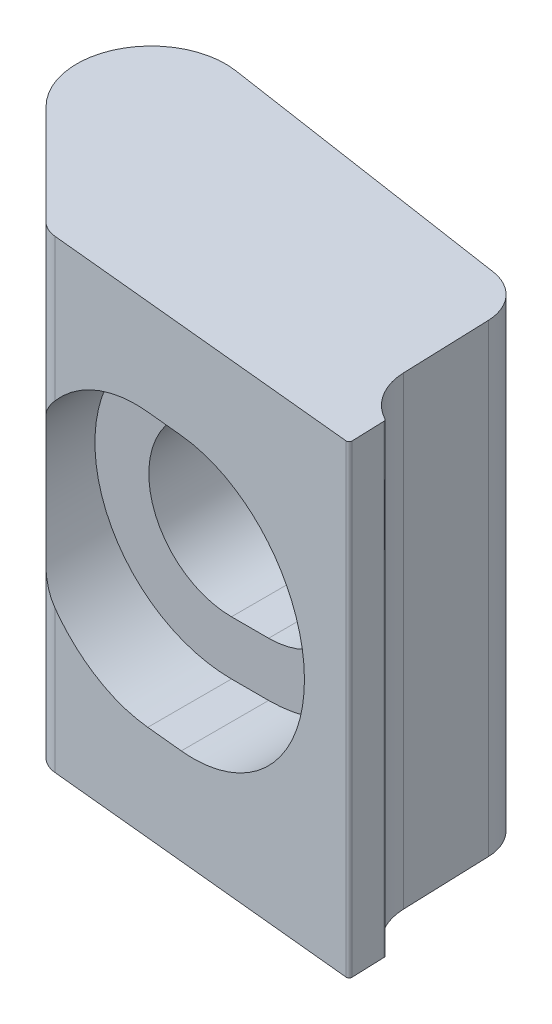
ISO-10303-21;
HEADER;
FILE_DESCRIPTION(('STEP AP214'),'2;1');
FILE_NAME('part.step','',(''),(''),'','','');
FILE_SCHEMA(('AUTOMOTIVE_DESIGN { 1 0 10303 214 1 1 1 1 }'));
ENDSEC;
DATA;
#1=APPLICATION_CONTEXT('core data for automotive mechanical design processes');
#2=APPLICATION_PROTOCOL_DEFINITION('international standard','automotive_design',2000,#1);
#3=PRODUCT_CONTEXT('',#1,'mechanical');
#4=PRODUCT('Part','Part','',(#3));
#5=PRODUCT_RELATED_PRODUCT_CATEGORY('part','',(#4));
#6=PRODUCT_DEFINITION_FORMATION('','',#4);
#7=PRODUCT_DEFINITION_CONTEXT('part definition',#1,'design');
#8=PRODUCT_DEFINITION('design','',#6,#7);
#9=PRODUCT_DEFINITION_SHAPE('','',#8);
#10=(LENGTH_UNIT() NAMED_UNIT(*) SI_UNIT(.MILLI.,.METRE.));
#11=(NAMED_UNIT(*) PLANE_ANGLE_UNIT() SI_UNIT($,.RADIAN.));
#12=(NAMED_UNIT(*) SI_UNIT($,.STERADIAN.) SOLID_ANGLE_UNIT());
#13=UNCERTAINTY_MEASURE_WITH_UNIT(LENGTH_MEASURE(1.E-05),#10,'distance_accuracy_value','');
#14=(GEOMETRIC_REPRESENTATION_CONTEXT(3) GLOBAL_UNCERTAINTY_ASSIGNED_CONTEXT((#13)) GLOBAL_UNIT_ASSIGNED_CONTEXT((#10,
#11,#12)) REPRESENTATION_CONTEXT('',''));
#15=CARTESIAN_POINT('',(0.,0.,0.));
#16=DIRECTION('',(0.,0.,1.));
#17=DIRECTION('',(1.,0.,0.));
#18=AXIS2_PLACEMENT_3D('',#15,#16,#17);
#19=CARTESIAN_POINT('',(-5.6332114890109,9.525,8.48578534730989));
#20=DIRECTION('',(0.,-1.,0.));
#21=DIRECTION('',(1.,0.,0.));
#22=AXIS2_PLACEMENT_3D('',#19,#20,#21);
#23=CYLINDRICAL_SURFACE('',#22,1.143);
#24=DIRECTION('',(0.,-1.,0.));
#25=VECTOR('',#24,1.);
#26=CARTESIAN_POINT('',(-6.44143453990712,9.525,9.29400839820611));
#27=LINE('',#26,#25);
#28=CARTESIAN_POINT('',(-6.44143453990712,9.525,9.29400839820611));
#29=VERTEX_POINT('',#28);
#30=CARTESIAN_POINT('',(-6.44143453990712,2.68079802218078,9.29400839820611));
#31=VERTEX_POINT('',#30);
#32=EDGE_CURVE('E192',#29,#31,#27,.T.);
#33=ORIENTED_EDGE('',*,*,#32,.T.);
#34=CARTESIAN_POINT('',(-4.4902114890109,4.75072940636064,8.48578534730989));
#35=CARTESIAN_POINT('',(-4.49021469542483,4.75072833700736,8.42949001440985));
#36=CARTESIAN_POINT('',(-4.49439454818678,4.74812553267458,8.3731533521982));
#37=CARTESIAN_POINT('',(-4.51089792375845,4.73776021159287,8.26213643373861));
#38=CARTESIAN_POINT('',(-4.52323094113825,4.72999167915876,8.2074581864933));
#39=CARTESIAN_POINT('',(-4.5553350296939,4.70948055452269,8.10148309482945));
#40=CARTESIAN_POINT('',(-4.57508705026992,4.69675069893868,8.05017798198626));
#41=CARTESIAN_POINT('',(-4.62102342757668,4.66658735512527,7.95206193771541));
#42=CARTESIAN_POINT('',(-4.64720715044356,4.64915433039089,7.90525056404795));
#43=CARTESIAN_POINT('',(-4.70591191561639,4.60918444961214,7.81529323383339));
#44=CARTESIAN_POINT('',(-4.73863845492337,4.58647665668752,7.77235832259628));
#45=CARTESIAN_POINT('',(-4.8083018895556,4.53685258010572,7.69283410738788));
#46=CARTESIAN_POINT('',(-4.84524018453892,4.50993489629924,7.65624692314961));
#47=CARTESIAN_POINT('',(-4.92692834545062,4.4486897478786,7.5852825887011));
#48=CARTESIAN_POINT('',(-4.9720712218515,4.41385436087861,7.55179932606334));
#49=CARTESIAN_POINT('',(-5.06431471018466,4.34022035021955,7.49290736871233));
#50=CARTESIAN_POINT('',(-5.11141662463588,4.30141906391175,7.46750414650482));
#51=CARTESIAN_POINT('',(-5.23147826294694,4.19898852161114,7.41273697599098));
#52=CARTESIAN_POINT('',(-5.30486740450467,4.13312974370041,7.38845180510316));
#53=CARTESIAN_POINT('',(-5.44979945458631,3.99574768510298,7.3551373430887));
#54=CARTESIAN_POINT('',(-5.52133763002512,3.92421148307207,7.34614396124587));
#55=CARTESIAN_POINT('',(-5.68811006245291,3.74805667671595,7.3399700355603));
#56=CARTESIAN_POINT('',(-5.78153990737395,3.64153383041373,7.34886026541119));
#57=CARTESIAN_POINT('',(-5.95848782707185,3.42387599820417,7.38630827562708));
#58=CARTESIAN_POINT('',(-6.04199262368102,3.31273509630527,7.41489206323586));
#59=CARTESIAN_POINT('',(-6.16039883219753,3.14271287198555,7.47064964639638));
#60=CARTESIAN_POINT('',(-6.19928710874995,3.08453155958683,7.49182979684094));
#61=CARTESIAN_POINT('',(-6.27413970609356,2.96796307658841,7.5383656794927));
#62=CARTESIAN_POINT('',(-6.31010466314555,2.90957595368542,7.56372049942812));
#63=CARTESIAN_POINT('',(-6.37910161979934,2.79292379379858,7.61858116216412));
#64=CARTESIAN_POINT('',(-6.41213062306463,2.73465893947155,7.64809116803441));
#65=CARTESIAN_POINT('',(-6.47512508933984,2.6188827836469,7.71143199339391));
#66=CARTESIAN_POINT('',(-6.50509223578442,2.56137108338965,7.74526041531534));
#67=CARTESIAN_POINT('',(-6.5663891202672,2.43875650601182,7.82359159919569));
#68=CARTESIAN_POINT('',(-6.59717682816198,2.3739020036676,7.86893635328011));
#69=CARTESIAN_POINT('',(-6.63964580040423,2.28017353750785,7.94325437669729));
#70=CARTESIAN_POINT('',(-6.65315959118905,2.24958163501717,7.96901837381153));
#71=CARTESIAN_POINT('',(-6.67881238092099,2.19015737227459,8.02311199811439));
#72=CARTESIAN_POINT('',(-6.6909528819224,2.16132310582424,8.05143875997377));
#73=CARTESIAN_POINT('',(-6.71077901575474,2.11321201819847,8.10385033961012));
#74=CARTESIAN_POINT('',(-6.71882286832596,2.09333806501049,8.12724558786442));
#75=CARTESIAN_POINT('',(-6.73378340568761,2.05582212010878,8.17619443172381));
#76=CARTESIAN_POINT('',(-6.74069839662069,2.03818349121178,8.20175118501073));
#77=CARTESIAN_POINT('',(-6.75314803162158,2.00602896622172,8.25563964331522));
#78=CARTESIAN_POINT('',(-6.75866201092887,1.99156021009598,8.28400516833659));
#79=CARTESIAN_POINT('',(-6.76765888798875,1.96775198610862,8.34309859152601));
#80=CARTESIAN_POINT('',(-6.7711499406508,1.9583919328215,8.37381643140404));
#81=CARTESIAN_POINT('',(-6.77495968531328,1.94814870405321,8.42774084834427));
#82=CARTESIAN_POINT('',(-6.7758996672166,1.94560795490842,8.45058690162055));
#83=CARTESIAN_POINT('',(-6.77639118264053,1.94428095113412,8.49640589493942));
#84=CARTESIAN_POINT('',(-6.77594303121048,1.94549384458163,8.51937880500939));
#85=CARTESIAN_POINT('',(-6.77371059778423,1.95150923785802,8.56468096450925));
#86=CARTESIAN_POINT('',(-6.77193112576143,1.95629881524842,8.58701223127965));
#87=CARTESIAN_POINT('',(-6.76720615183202,1.96892736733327,8.63065948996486));
#88=CARTESIAN_POINT('',(-6.76425949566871,1.97676936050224,8.651974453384));
#89=CARTESIAN_POINT('',(-6.75514560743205,2.00080201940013,8.70697018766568));
#90=CARTESIAN_POINT('',(-6.74813407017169,2.01909369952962,8.73958211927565));
#91=CARTESIAN_POINT('',(-6.73219451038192,2.05986233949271,8.80156563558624));
#92=CARTESIAN_POINT('',(-6.72325966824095,2.08235415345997,8.8309251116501));
#93=CARTESIAN_POINT('',(-6.70376213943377,2.13039655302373,8.88737774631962));
#94=CARTESIAN_POINT('',(-6.69317265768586,2.15599557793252,8.91441960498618));
#95=CARTESIAN_POINT('',(-6.67075263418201,2.20898407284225,8.96615056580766));
#96=CARTESIAN_POINT('',(-6.65892079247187,2.23637540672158,8.99083715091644));
#97=CARTESIAN_POINT('',(-6.62176738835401,2.32041919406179,9.06206003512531));
#98=CARTESIAN_POINT('',(-6.59482686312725,2.37884384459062,9.10565429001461));
#99=CARTESIAN_POINT('',(-6.5360415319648,2.50041196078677,9.18865699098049));
#100=CARTESIAN_POINT('',(-6.5040355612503,2.56365029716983,9.22780455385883));
#101=CARTESIAN_POINT('',(-6.4362361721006,2.69128280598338,9.30069463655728));
#102=CARTESIAN_POINT('',(-6.40043930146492,2.75567798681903,9.33443215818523));
#103=CARTESIAN_POINT('',(-6.32518499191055,2.88479628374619,9.39683382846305));
#104=CARTESIAN_POINT('',(-6.28572706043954,2.94951944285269,9.42549729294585));
#105=CARTESIAN_POINT('',(-6.20321759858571,3.07874116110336,9.47771434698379));
#106=CARTESIAN_POINT('',(-6.16016532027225,3.14323967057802,9.50126686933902));
#107=CARTESIAN_POINT('',(-6.03710812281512,3.31938624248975,9.55852949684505));
#108=CARTESIAN_POINT('',(-5.95346329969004,3.43037193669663,9.58673960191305));
#109=CARTESIAN_POINT('',(-5.77637875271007,3.64755014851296,9.62336608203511));
#110=CARTESIAN_POINT('',(-5.68296439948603,3.75375410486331,9.63183245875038));
#111=CARTESIAN_POINT('',(-5.5191909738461,3.92628603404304,9.62503834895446));
#112=CARTESIAN_POINT('',(-5.45076212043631,3.9946943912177,9.61637222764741));
#113=CARTESIAN_POINT('',(-5.31211391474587,4.12639234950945,9.585049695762));
#114=CARTESIAN_POINT('',(-5.2418966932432,4.1896876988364,9.56240925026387));
#115=CARTESIAN_POINT('',(-5.11714942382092,4.29679110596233,9.50742685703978));
#116=CARTESIAN_POINT('',(-5.06241466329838,4.34190375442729,9.47811092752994));
#117=CARTESIAN_POINT('',(-4.95572646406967,4.42670472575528,9.40855466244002));
#118=CARTESIAN_POINT('',(-4.90376966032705,4.46639970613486,9.36832791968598));
#119=CARTESIAN_POINT('',(-4.81354641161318,4.53313823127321,9.28437004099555));
#120=CARTESIAN_POINT('',(-4.77444211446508,4.56118760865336,9.2423433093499));
#121=CARTESIAN_POINT('',(-4.70181412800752,4.61208245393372,9.15088102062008));
#122=CARTESIAN_POINT('',(-4.66829051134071,4.63492785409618,9.10144536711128));
#123=CARTESIAN_POINT('',(-4.60849504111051,4.67493748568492,8.99579804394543));
#124=CARTESIAN_POINT('',(-4.58226962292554,4.69206547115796,8.9395461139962));
#125=CARTESIAN_POINT('',(-4.53905343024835,4.71995391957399,8.82217796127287));
#126=CARTESIAN_POINT('',(-4.52204580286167,4.73072600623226,8.76107085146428));
#127=CARTESIAN_POINT('',(-4.50358675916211,4.74235789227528,8.66373907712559));
#128=CARTESIAN_POINT('',(-4.49858295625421,4.74549386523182,8.62841295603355));
#129=CARTESIAN_POINT('',(-4.49189443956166,4.74967987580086,8.55732521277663));
#130=CARTESIAN_POINT('',(-4.49020945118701,4.75073008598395,8.52156362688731));
#131=CARTESIAN_POINT('',(-4.4902114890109,4.75072940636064,8.48578534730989));
#132=B_SPLINE_CURVE_WITH_KNOTS('',3,(#34,#35,#36,#37,#38,#39,#40,#41,#42,#43,#44,#45,#46,#47,
#48,#49,#50,#51,#52,#53,#54,#55,#56,#57,#58,#59,#60,#61,#62,#63,#64,#65,#66,#67,#68,#69,#70,#71,
#72,#73,#74,#75,#76,#77,#78,#79,#80,#81,#82,#83,#84,#85,#86,#87,#88,#89,#90,#91,#92,#93,#94,#95,
#96,#97,#98,#99,#100,#101,#102,#103,#104,#105,#106,#107,#108,#109,#110,#111,#112,#113,#114,#115,
#116,#117,#118,#119,#120,#121,#122,#123,#124,#125,#126,#127,#128,#129,#130,#131),.UNSPECIFIED.,
.T.,.F.,(4,2,2,2,2,2,2,2,2,2,2,2,2,2,2,2,2,2,2,2,2,2,2,2,2,2,2,2,2,2,2,2,2,2,2,2,2,2,2,2,2,2,2,
2,2,2,2,2,4),(0.,0.168746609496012,0.33769007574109,0.506202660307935,0.6746986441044,
0.849694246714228,1.02474817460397,1.22238324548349,1.42015188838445,1.72310054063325,
2.02675962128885,2.45038828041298,2.8745774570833,3.09377987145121,3.31293444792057,
3.53231017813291,3.75156463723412,4.00570961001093,4.13226772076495,4.25868604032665,
4.35376083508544,4.44897700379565,4.54552526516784,4.64168155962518,4.71037401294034,
4.77905087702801,4.84748080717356,4.9159785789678,5.0294469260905,5.14332443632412,
5.25928570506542,5.37536954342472,5.60797929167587,5.85059968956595,6.09344296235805,
6.33631895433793,6.57924561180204,7.00310547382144,7.42589072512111,7.71640614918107,
8.00659028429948,8.2359829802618,8.46509119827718,8.65597505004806,8.84686138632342,
9.03893584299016,9.23065793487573,9.33791305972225,9.44515931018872),.UNSPECIFIED.);
#133=CARTESIAN_POINT('',(-5.7447487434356,3.68145630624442,9.62333026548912));
#134=VERTEX_POINT('',#133);
#135=EDGE_CURVE('E211',#31,#134,#132,.T.);
#136=ORIENTED_EDGE('',*,*,#135,.T.);
#137=DIRECTION('',(0.,-1.,0.));
#138=VECTOR('',#137,1.);
#139=CARTESIAN_POINT('',(-5.7447487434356,9.525,9.62333026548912));
#140=LINE('',#139,#138);
#141=CARTESIAN_POINT('',(-5.7447487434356,9.525,9.62333026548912));
#142=VERTEX_POINT('',#141);
#143=EDGE_CURVE('E237',#142,#134,#140,.T.);
#144=ORIENTED_EDGE('',*,*,#143,.F.);
#145=CARTESIAN_POINT('',(-5.6332114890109,9.525,8.48578534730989));
#146=DIRECTION('',(0.,1.,0.));
#147=DIRECTION('',(1.,0.,0.));
#148=AXIS2_PLACEMENT_3D('',#145,#146,#147);
#149=CIRCLE('',#148,1.143);
#150=EDGE_CURVE('E250',#29,#142,#149,.T.);
#151=ORIENTED_EDGE('',*,*,#150,.F.);
#152=EDGE_LOOP('',(#33,#136,#144,#151));
#153=FACE_BOUND('',#152,.T.);
#154=ADVANCED_FACE('F14',(#153),#23,.T.);
#155=CARTESIAN_POINT('',(-8.37692,9.525,3.048));
#156=DIRECTION('',(0.,-1.,0.));
#157=DIRECTION('',(1.,0.,0.));
#158=AXIS2_PLACEMENT_3D('',#155,#156,#157);
#159=CYLINDRICAL_SURFACE('',#158,3.048);
#160=CARTESIAN_POINT('',(-8.37692,-9.525,3.048));
#161=DIRECTION('',(0.,1.,0.));
#162=DIRECTION('',(-1.,0.,0.));
#163=AXIS2_PLACEMENT_3D('',#160,#161,#162);
#164=CIRCLE('',#163,3.048);
#165=CARTESIAN_POINT('',(-7.92431353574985,-9.525,0.0337917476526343));
#166=VERTEX_POINT('',#165);
#167=CARTESIAN_POINT('',(-10.5321814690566,-9.525,5.20326146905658));
#168=VERTEX_POINT('',#167);
#169=EDGE_CURVE('E259',#166,#168,#164,.T.);
#170=ORIENTED_EDGE('',*,*,#169,.T.);
#171=DIRECTION('',(0.,-1.,0.));
#172=VECTOR('',#171,1.);
#173=CARTESIAN_POINT('',(-10.5321814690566,9.525,5.20326146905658));
#174=LINE('',#173,#172);
#175=CARTESIAN_POINT('',(-10.5321814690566,9.525,5.20326146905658));
#176=VERTEX_POINT('',#175);
#177=EDGE_CURVE('E187',#176,#168,#174,.T.);
#178=ORIENTED_EDGE('',*,*,#177,.F.);
#179=CARTESIAN_POINT('',(-8.37692,9.525,3.048));
#180=DIRECTION('',(0.,1.,0.));
#181=DIRECTION('',(-1.,0.,0.));
#182=AXIS2_PLACEMENT_3D('',#179,#180,#181);
#183=CIRCLE('',#182,3.048);
#184=CARTESIAN_POINT('',(-7.92431353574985,9.525,0.0337917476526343));
#185=VERTEX_POINT('',#184);
#186=EDGE_CURVE('E365',#185,#176,#183,.T.);
#187=ORIENTED_EDGE('',*,*,#186,.F.);
#188=DIRECTION('',(0.,-1.,0.));
#189=VECTOR('',#188,1.);
#190=CARTESIAN_POINT('',(-7.92431353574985,9.525,0.0337917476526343));
#191=LINE('',#190,#189);
#192=EDGE_CURVE('E341',#185,#166,#191,.T.);
#193=ORIENTED_EDGE('',*,*,#192,.T.);
#194=EDGE_LOOP('',(#170,#178,#187,#193));
#195=FACE_BOUND('',#194,.T.);
#196=ADVANCED_FACE('F326',(#195),#159,.T.);
#197=CARTESIAN_POINT('',(-6.44143453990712,9.525,9.29400839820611));
#198=DIRECTION('',(0.707106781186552,0.,-0.707106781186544));
#199=DIRECTION('',(-0.707106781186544,0.,-0.707106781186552));
#200=AXIS2_PLACEMENT_3D('',#197,#198,#199);
#201=PLANE('',#200);
#202=CARTESIAN_POINT('',(-6.44143453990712,-2.68079802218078,9.29400839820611));
#203=VERTEX_POINT('',#202);
#204=CARTESIAN_POINT('',(-6.44143453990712,-9.525,9.29400839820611));
#205=VERTEX_POINT('',#204);
#206=EDGE_CURVE('E242',#203,#205,#27,.T.);
#207=ORIENTED_EDGE('',*,*,#206,.F.);
#208=CARTESIAN_POINT('',(-1.524,0.,14.2114429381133));
#209=DIRECTION('',(0.707106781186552,0.,-0.707106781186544));
#210=DIRECTION('',(0.707106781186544,0.,0.707106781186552));
#211=AXIS2_PLACEMENT_3D('',#208,#209,#210);
#212=ELLIPSE('',#211,7.92058589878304,5.6007);
#213=EDGE_CURVE('E256',#203,#31,#212,.T.);
#214=ORIENTED_EDGE('',*,*,#213,.T.);
#215=ORIENTED_EDGE('',*,*,#32,.F.);
#216=DIRECTION('',(0.707106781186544,0.,0.707106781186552));
#217=VECTOR('',#216,1.);
#218=CARTESIAN_POINT('',(-6.44143453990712,9.525,9.29400839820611));
#219=LINE('',#218,#217);
#220=EDGE_CURVE('E255',#176,#29,#219,.T.);
#221=ORIENTED_EDGE('',*,*,#220,.F.);
#222=ORIENTED_EDGE('',*,*,#177,.T.);
#223=DIRECTION('',(0.707106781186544,0.,0.707106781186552));
#224=VECTOR('',#223,1.);
#225=CARTESIAN_POINT('',(-6.44143453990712,-9.525,9.29400839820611));
#226=LINE('',#225,#224);
#227=EDGE_CURVE('E343',#168,#205,#226,.T.);
#228=ORIENTED_EDGE('',*,*,#227,.T.);
#229=EDGE_LOOP('',(#207,#214,#215,#221,#222,#228));
#230=FACE_BOUND('',#229,.T.);
#231=ADVANCED_FACE('F254',(#230),#201,.F.);
#232=CARTESIAN_POINT('',(-5.7447487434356,-3.68145630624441,9.62333026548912));
#233=VERTEX_POINT('',#232);
#234=CARTESIAN_POINT('',(-5.7447487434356,-9.525,9.62333026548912));
#235=VERTEX_POINT('',#234);
#236=EDGE_CURVE('E243',#233,#235,#140,.T.);
#237=ORIENTED_EDGE('',*,*,#236,.F.);
#238=CARTESIAN_POINT('',(-4.4902114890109,-4.75072940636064,8.48578534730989));
#239=CARTESIAN_POINT('',(-4.49021469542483,-4.75072833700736,8.54208068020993));
#240=CARTESIAN_POINT('',(-4.49439454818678,-4.74812553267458,8.59841734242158));
#241=CARTESIAN_POINT('',(-4.51089792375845,-4.73776021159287,8.70943426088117));
#242=CARTESIAN_POINT('',(-4.52323094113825,-4.72999167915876,8.76411250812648));
#243=CARTESIAN_POINT('',(-4.5553350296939,-4.70948055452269,8.87008759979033));
#244=CARTESIAN_POINT('',(-4.57508705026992,-4.69675069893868,8.92139271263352));
#245=CARTESIAN_POINT('',(-4.62102342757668,-4.66658735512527,9.01950875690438));
#246=CARTESIAN_POINT('',(-4.64720715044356,-4.64915433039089,9.06632013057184));
#247=CARTESIAN_POINT('',(-4.70591191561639,-4.60918444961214,9.1562774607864));
#248=CARTESIAN_POINT('',(-4.73863845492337,-4.58647665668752,9.19921237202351));
#249=CARTESIAN_POINT('',(-4.8083018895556,-4.53685258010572,9.27873658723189));
#250=CARTESIAN_POINT('',(-4.84524018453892,-4.50993489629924,9.31532377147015));
#251=CARTESIAN_POINT('',(-4.92692834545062,-4.4486897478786,9.38628810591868));
#252=CARTESIAN_POINT('',(-4.9720712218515,-4.41385436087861,9.41977136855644));
#253=CARTESIAN_POINT('',(-5.06431471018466,-4.34022035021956,9.47866332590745));
#254=CARTESIAN_POINT('',(-5.11141662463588,-4.30141906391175,9.50406654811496));
#255=CARTESIAN_POINT('',(-5.23147826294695,-4.19898852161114,9.5588337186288));
#256=CARTESIAN_POINT('',(-5.30486740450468,-4.13312974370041,9.58311888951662));
#257=CARTESIAN_POINT('',(-5.44979945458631,-3.99574768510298,9.61643335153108));
#258=CARTESIAN_POINT('',(-5.52133763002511,-3.92421148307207,9.62542673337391));
#259=CARTESIAN_POINT('',(-5.68811006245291,-3.74805667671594,9.63160065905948));
#260=CARTESIAN_POINT('',(-5.78153990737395,-3.64153383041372,9.6227104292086));
#261=CARTESIAN_POINT('',(-5.95848782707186,-3.42387599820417,9.58526241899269));
#262=CARTESIAN_POINT('',(-6.04199262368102,-3.31273509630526,9.5566786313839));
#263=CARTESIAN_POINT('',(-6.16039883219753,-3.14271287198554,9.50092104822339));
#264=CARTESIAN_POINT('',(-6.19928710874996,-3.08453155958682,9.47974089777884));
#265=CARTESIAN_POINT('',(-6.27413970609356,-2.9679630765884,9.43320501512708));
#266=CARTESIAN_POINT('',(-6.31010466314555,-2.90957595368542,9.40785019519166));
#267=CARTESIAN_POINT('',(-6.37910161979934,-2.79292379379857,9.35298953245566));
#268=CARTESIAN_POINT('',(-6.41213062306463,-2.73465893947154,9.32347952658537));
#269=CARTESIAN_POINT('',(-6.47512508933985,-2.61888278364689,9.26013870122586));
#270=CARTESIAN_POINT('',(-6.50509223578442,-2.56137108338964,9.22631027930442));
#271=CARTESIAN_POINT('',(-6.5663891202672,-2.43875650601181,9.14797909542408));
#272=CARTESIAN_POINT('',(-6.59717682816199,-2.37390200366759,9.10263434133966));
#273=CARTESIAN_POINT('',(-6.63964580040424,-2.28017353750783,9.02831631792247));
#274=CARTESIAN_POINT('',(-6.65315959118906,-2.24958163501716,9.00255232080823));
#275=CARTESIAN_POINT('',(-6.678812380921,-2.19015737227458,8.94845869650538));
#276=CARTESIAN_POINT('',(-6.69095288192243,-2.16132310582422,8.92013193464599));
#277=CARTESIAN_POINT('',(-6.71077901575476,-2.11321201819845,8.86772035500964));
#278=CARTESIAN_POINT('',(-6.71882286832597,-2.09333806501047,8.84432510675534));
#279=CARTESIAN_POINT('',(-6.73378340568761,-2.05582212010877,8.79537626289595));
#280=CARTESIAN_POINT('',(-6.74069839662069,-2.03818349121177,8.76981950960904));
#281=CARTESIAN_POINT('',(-6.75314803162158,-2.00602896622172,8.71593105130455));
#282=CARTESIAN_POINT('',(-6.75866201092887,-1.99156021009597,8.68756552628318));
#283=CARTESIAN_POINT('',(-6.76765888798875,-1.96775198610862,8.62847210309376));
#284=CARTESIAN_POINT('',(-6.7711499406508,-1.9583919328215,8.59775426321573));
#285=CARTESIAN_POINT('',(-6.77495968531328,-1.94814870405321,8.54382984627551));
#286=CARTESIAN_POINT('',(-6.7758996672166,-1.94560795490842,8.52098379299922));
#287=CARTESIAN_POINT('',(-6.77639118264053,-1.94428095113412,8.47516479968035));
#288=CARTESIAN_POINT('',(-6.77594303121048,-1.94549384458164,8.45219188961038));
#289=CARTESIAN_POINT('',(-6.77371059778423,-1.95150923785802,8.40688973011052));
#290=CARTESIAN_POINT('',(-6.77193112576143,-1.95629881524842,8.38455846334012));
#291=CARTESIAN_POINT('',(-6.76720615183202,-1.96892736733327,8.34091120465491));
#292=CARTESIAN_POINT('',(-6.76425949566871,-1.97676936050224,8.31959624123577));
#293=CARTESIAN_POINT('',(-6.75514560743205,-2.00080201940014,8.26460050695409));
#294=CARTESIAN_POINT('',(-6.74813407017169,-2.01909369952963,8.23198857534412));
#295=CARTESIAN_POINT('',(-6.73219451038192,-2.05986233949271,8.17000505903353));
#296=CARTESIAN_POINT('',(-6.72325966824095,-2.08235415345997,8.14064558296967));
#297=CARTESIAN_POINT('',(-6.70376213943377,-2.13039655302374,8.08419294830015));
#298=CARTESIAN_POINT('',(-6.69317265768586,-2.15599557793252,8.05715108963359));
#299=CARTESIAN_POINT('',(-6.670752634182,-2.20898407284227,8.00542012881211));
#300=CARTESIAN_POINT('',(-6.65892079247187,-2.23637540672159,7.98073354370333));
#301=CARTESIAN_POINT('',(-6.621767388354,-2.3204191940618,7.90951065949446));
#302=CARTESIAN_POINT('',(-6.59482686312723,-2.37884384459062,7.86591640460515));
#303=CARTESIAN_POINT('',(-6.53604153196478,-2.50041196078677,7.78291370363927));
#304=CARTESIAN_POINT('',(-6.50403556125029,-2.56365029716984,7.74376614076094));
#305=CARTESIAN_POINT('',(-6.43623617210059,-2.6912828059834,7.67087605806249));
#306=CARTESIAN_POINT('',(-6.40043930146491,-2.75567798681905,7.63713853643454));
#307=CARTESIAN_POINT('',(-6.32518499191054,-2.88479628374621,7.57473686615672));
#308=CARTESIAN_POINT('',(-6.28572706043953,-2.94951944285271,7.54607340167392));
#309=CARTESIAN_POINT('',(-6.20321759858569,-3.07874116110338,7.49385634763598));
#310=CARTESIAN_POINT('',(-6.16016532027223,-3.14323967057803,7.47030382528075));
#311=CARTESIAN_POINT('',(-6.0371081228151,-3.31938624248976,7.41304119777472));
#312=CARTESIAN_POINT('',(-5.95346329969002,-3.43037193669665,7.38483109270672));
#313=CARTESIAN_POINT('',(-5.77637875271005,-3.64755014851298,7.34820461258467));
#314=CARTESIAN_POINT('',(-5.68296439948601,-3.75375410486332,7.33973823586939));
#315=CARTESIAN_POINT('',(-5.51919097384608,-3.92628603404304,7.34653234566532));
#316=CARTESIAN_POINT('',(-5.4507621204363,-3.99469439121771,7.35519846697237));
#317=CARTESIAN_POINT('',(-5.31211391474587,-4.12639234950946,7.38652099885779));
#318=CARTESIAN_POINT('',(-5.2418966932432,-4.18968769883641,7.40916144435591));
#319=CARTESIAN_POINT('',(-5.11714942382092,-4.29679110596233,7.46414383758));
#320=CARTESIAN_POINT('',(-5.06241466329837,-4.34190375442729,7.49345976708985));
#321=CARTESIAN_POINT('',(-4.95572646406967,-4.42670472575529,7.56301603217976));
#322=CARTESIAN_POINT('',(-4.90376966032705,-4.46639970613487,7.6032427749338));
#323=CARTESIAN_POINT('',(-4.81354641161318,-4.53313823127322,7.68720065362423));
#324=CARTESIAN_POINT('',(-4.77444211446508,-4.56118760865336,7.72922738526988));
#325=CARTESIAN_POINT('',(-4.70181412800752,-4.61208245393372,7.82068967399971));
#326=CARTESIAN_POINT('',(-4.66829051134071,-4.63492785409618,7.8701253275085));
#327=CARTESIAN_POINT('',(-4.60849504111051,-4.67493748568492,7.97577265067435));
#328=CARTESIAN_POINT('',(-4.58226962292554,-4.69206547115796,8.03202458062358));
#329=CARTESIAN_POINT('',(-4.53905343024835,-4.71995391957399,8.14939273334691));
#330=CARTESIAN_POINT('',(-4.52204580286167,-4.73072600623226,8.21049984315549));
#331=CARTESIAN_POINT('',(-4.50358675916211,-4.74235789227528,8.30783161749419));
#332=CARTESIAN_POINT('',(-4.49858295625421,-4.74549386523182,8.34315773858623));
#333=CARTESIAN_POINT('',(-4.49189443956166,-4.74967987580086,8.41424548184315));
#334=CARTESIAN_POINT('',(-4.49020945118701,-4.75073008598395,8.45000706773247));
#335=CARTESIAN_POINT('',(-4.4902114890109,-4.75072940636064,8.48578534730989));
#336=B_SPLINE_CURVE_WITH_KNOTS('',3,(#238,#239,#240,#241,#242,#243,#244,#245,#246,#247,#248,
#249,#250,#251,#252,#253,#254,#255,#256,#257,#258,#259,#260,#261,#262,#263,#264,#265,#266,#267,
#268,#269,#270,#271,#272,#273,#274,#275,#276,#277,#278,#279,#280,#281,#282,#283,#284,#285,#286,
#287,#288,#289,#290,#291,#292,#293,#294,#295,#296,#297,#298,#299,#300,#301,#302,#303,#304,#305,
#306,#307,#308,#309,#310,#311,#312,#313,#314,#315,#316,#317,#318,#319,#320,#321,#322,#323,#324,
#325,#326,#327,#328,#329,#330,#331,#332,#333,#334,#335),.UNSPECIFIED.,.T.,.F.,(4,2,2,2,2,2,2,2,
2,2,2,2,2,2,2,2,2,2,2,2,2,2,2,2,2,2,2,2,2,2,2,2,2,2,2,2,2,2,2,2,2,2,2,2,2,2,2,2,4),(0.,
0.168746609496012,0.33769007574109,0.50620266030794,0.674698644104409,0.849694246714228,
1.02474817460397,1.22238324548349,1.42015188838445,1.72310054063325,2.02675962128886,
2.45038828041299,2.87457745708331,3.09377987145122,3.31293444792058,3.53231017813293,
3.75156463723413,4.00570961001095,4.13226772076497,4.25868604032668,4.35376083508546,
4.44897700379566,4.54552526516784,4.64168155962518,4.71037401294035,4.77905087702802,
4.84748080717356,4.91597857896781,5.02944692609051,5.14332443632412,5.25928570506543,
5.37536954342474,5.60797929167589,5.85059968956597,6.09344296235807,6.33631895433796,
6.57924561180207,7.00310547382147,7.42589072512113,7.71640614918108,8.00659028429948,
8.2359829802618,8.46509119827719,8.65597505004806,8.84686138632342,9.03893584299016,
9.23065793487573,9.33791305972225,9.44515931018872),.UNSPECIFIED.);
#337=EDGE_CURVE('E180',#233,#203,#336,.T.);
#338=ORIENTED_EDGE('',*,*,#337,.T.);
#339=ORIENTED_EDGE('',*,*,#206,.T.);
#340=CARTESIAN_POINT('',(-5.6332114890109,-9.525,8.48578534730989));
#341=DIRECTION('',(0.,1.,0.));
#342=DIRECTION('',(1.,0.,0.));
#343=AXIS2_PLACEMENT_3D('',#340,#341,#342);
#344=CIRCLE('',#343,1.143);
#345=EDGE_CURVE('E344',#205,#235,#344,.T.);
#346=ORIENTED_EDGE('',*,*,#345,.T.);
#347=EDGE_LOOP('',(#237,#338,#339,#346));
#348=FACE_BOUND('',#347,.T.);
#349=ADVANCED_FACE('F273',(#348),#23,.T.);
#350=CARTESIAN_POINT('',(7.49454627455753,9.525,10.9214544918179));
#351=DIRECTION('',(0.0975828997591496,0.,-0.995227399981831));
#352=DIRECTION('',(-0.995227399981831,0.,-0.0975828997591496));
#353=AXIS2_PLACEMENT_3D('',#350,#351,#352);
#354=PLANE('',#353);
#355=DIRECTION('',(-0.995227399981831,0.,-0.0975828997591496));
#356=VECTOR('',#355,1.);
#357=CARTESIAN_POINT('',(7.49454627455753,-5.6007,10.9214544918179));
#358=LINE('',#357,#356);
#359=CARTESIAN_POINT('',(0.,-5.6007,10.186607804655));
#360=VERTEX_POINT('',#359);
#361=CARTESIAN_POINT('',(-1.524,-5.6007,10.0371782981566));
#362=VERTEX_POINT('',#361);
#363=EDGE_CURVE('E173',#360,#362,#358,.T.);
#364=ORIENTED_EDGE('',*,*,#363,.T.);
#365=CARTESIAN_POINT('',(-1.524,0.,10.0371782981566));
#366=DIRECTION('',(0.0975828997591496,0.,-0.995227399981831));
#367=DIRECTION('',(0.995227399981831,0.,0.0975828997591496));
#368=AXIS2_PLACEMENT_3D('',#365,#366,#367);
#369=ELLIPSE('',#368,5.62755808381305,5.6007);
#370=EDGE_CURVE('E9',#362,#233,#369,.T.);
#371=ORIENTED_EDGE('',*,*,#370,.T.);
#372=ORIENTED_EDGE('',*,*,#236,.T.);
#373=DIRECTION('',(0.995227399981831,0.,0.0975828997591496));
#374=VECTOR('',#373,1.);
#375=CARTESIAN_POINT('',(7.49454627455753,-9.525,10.9214544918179));
#376=LINE('',#375,#374);
#377=CARTESIAN_POINT('',(7.49454627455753,-9.525,10.9214544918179));
#378=VERTEX_POINT('',#377);
#379=EDGE_CURVE('E347',#235,#378,#376,.T.);
#380=ORIENTED_EDGE('',*,*,#379,.T.);
#381=DIRECTION('',(0.,-1.,0.));
#382=VECTOR('',#381,1.);
#383=CARTESIAN_POINT('',(7.49454627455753,9.525,10.9214544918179));
#384=LINE('',#383,#382);
#385=CARTESIAN_POINT('',(7.49454627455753,9.525,10.9214544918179));
#386=VERTEX_POINT('',#385);
#387=EDGE_CURVE('E245',#386,#378,#384,.T.);
#388=ORIENTED_EDGE('',*,*,#387,.F.);
#389=DIRECTION('',(0.995227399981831,0.,0.0975828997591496));
#390=VECTOR('',#389,1.);
#391=CARTESIAN_POINT('',(7.49454627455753,9.525,10.9214544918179));
#392=LINE('',#391,#390);
#393=EDGE_CURVE('E239',#142,#386,#392,.T.);
#394=ORIENTED_EDGE('',*,*,#393,.F.);
#395=ORIENTED_EDGE('',*,*,#143,.T.);
#396=CARTESIAN_POINT('',(-1.524,5.6007,10.0371782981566));
#397=VERTEX_POINT('',#396);
#398=EDGE_CURVE('E24',#134,#397,#369,.T.);
#399=ORIENTED_EDGE('',*,*,#398,.T.);
#400=DIRECTION('',(0.995227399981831,0.,0.0975828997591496));
#401=VECTOR('',#400,1.);
#402=CARTESIAN_POINT('',(7.49454627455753,5.6007,10.9214544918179));
#403=LINE('',#402,#401);
#404=CARTESIAN_POINT('',(0.,5.6007,10.186607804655));
#405=VERTEX_POINT('',#404);
#406=EDGE_CURVE('E189',#397,#405,#403,.T.);
#407=ORIENTED_EDGE('',*,*,#406,.T.);
#408=CARTESIAN_POINT('',(0.,0.,10.186607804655));
#409=DIRECTION('',(0.0975828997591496,0.,-0.995227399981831));
#410=DIRECTION('',(0.995227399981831,0.,0.0975828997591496));
#411=AXIS2_PLACEMENT_3D('',#408,#409,#410);
#412=ELLIPSE('',#411,5.62755808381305,5.6007);
#413=EDGE_CURVE('E186',#405,#360,#412,.T.);
#414=ORIENTED_EDGE('',*,*,#413,.T.);
#415=EDGE_LOOP('',(#364,#371,#372,#380,#388,#394,#395,#399,#407,#414));
#416=FACE_BOUND('',#415,.T.);
#417=ADVANCED_FACE('F184',(#416),#354,.F.);
#418=CARTESIAN_POINT('',(7.5057,9.525,10.8077));
#419=DIRECTION('',(0.,-1.,0.));
#420=DIRECTION('',(1.,0.,0.));
#421=AXIS2_PLACEMENT_3D('',#418,#419,#420);
#422=CYLINDRICAL_SURFACE('',#421,0.1143);
#423=CARTESIAN_POINT('',(7.5057,-9.525,10.8077));
#424=DIRECTION('',(0.,1.,0.));
#425=DIRECTION('',(-1.,0.,0.));
#426=AXIS2_PLACEMENT_3D('',#423,#424,#425);
#427=CIRCLE('',#426,0.1143);
#428=CARTESIAN_POINT('',(7.61993037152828,-9.525,10.8037109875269));
#429=VERTEX_POINT('',#428);
#430=EDGE_CURVE('E351',#378,#429,#427,.T.);
#431=ORIENTED_EDGE('',*,*,#430,.T.);
#432=DIRECTION('',(0.,-1.,0.));
#433=VECTOR('',#432,1.);
#434=CARTESIAN_POINT('',(7.61993037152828,9.525,10.8037109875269));
#435=LINE('',#434,#433);
#436=CARTESIAN_POINT('',(7.61993037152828,9.525,10.8037109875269));
#437=VERTEX_POINT('',#436);
#438=EDGE_CURVE('E398',#437,#429,#435,.T.);
#439=ORIENTED_EDGE('',*,*,#438,.F.);
#440=CARTESIAN_POINT('',(7.5057,9.525,10.8077));
#441=DIRECTION('',(0.,1.,0.));
#442=DIRECTION('',(-1.,0.,0.));
#443=AXIS2_PLACEMENT_3D('',#440,#441,#442);
#444=CIRCLE('',#443,0.1143);
#445=EDGE_CURVE('E370',#386,#437,#444,.T.);
#446=ORIENTED_EDGE('',*,*,#445,.F.);
#447=ORIENTED_EDGE('',*,*,#387,.T.);
#448=EDGE_LOOP('',(#431,#439,#446,#447));
#449=FACE_BOUND('',#448,.T.);
#450=ADVANCED_FACE('F314',(#449),#422,.T.);
#451=CARTESIAN_POINT('',(7.61993037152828,9.525,10.8037109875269));
#452=DIRECTION('',(-0.999390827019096,0.,0.0348994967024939));
#453=DIRECTION('',(0.0348994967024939,0.,0.999390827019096));
#454=AXIS2_PLACEMENT_3D('',#451,#452,#453);
#455=PLANE('',#454);
#456=DIRECTION('',(-0.0348994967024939,0.,-0.999390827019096));
#457=VECTOR('',#456,1.);
#458=CARTESIAN_POINT('',(7.61993037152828,-9.525,10.8037109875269));
#459=LINE('',#458,#457);
#460=CARTESIAN_POINT('',(7.57241521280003,-9.525,9.44305486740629));
#461=VERTEX_POINT('',#460);
#462=EDGE_CURVE('E353',#429,#461,#459,.T.);
#463=ORIENTED_EDGE('',*,*,#462,.T.);
#464=DIRECTION('',(0.,-1.,0.));
#465=VECTOR('',#464,1.);
#466=CARTESIAN_POINT('',(7.57241521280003,9.525,9.44305486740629));
#467=LINE('',#466,#465);
#468=CARTESIAN_POINT('',(7.57241521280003,9.525,9.44305486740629));
#469=VERTEX_POINT('',#468);
#470=EDGE_CURVE('E396',#469,#461,#467,.T.);
#471=ORIENTED_EDGE('',*,*,#470,.F.);
#472=DIRECTION('',(-0.0348994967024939,0.,-0.999390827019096));
#473=VECTOR('',#472,1.);
#474=CARTESIAN_POINT('',(7.61993037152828,9.525,10.8037109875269));
#475=LINE('',#474,#473);
#476=EDGE_CURVE('E372',#437,#469,#475,.T.);
#477=ORIENTED_EDGE('',*,*,#476,.F.);
#478=ORIENTED_EDGE('',*,*,#438,.T.);
#479=EDGE_LOOP('',(#463,#471,#477,#478));
#480=FACE_BOUND('',#479,.T.);
#481=ADVANCED_FACE('F310',(#480),#455,.F.);
#482=CARTESIAN_POINT('',(7.45818484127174,9.525,9.44704387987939));
#483=DIRECTION('',(0.,-1.,0.));
#484=DIRECTION('',(1.,0.,0.));
#485=AXIS2_PLACEMENT_3D('',#482,#483,#484);
#486=CYLINDRICAL_SURFACE('',#485,0.1143);
#487=CARTESIAN_POINT('',(7.45818484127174,-9.525,9.44704387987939));
#488=DIRECTION('',(0.,1.,0.));
#489=DIRECTION('',(-1.,0.,0.));
#490=AXIS2_PLACEMENT_3D('',#487,#488,#489);
#491=CIRCLE('',#490,0.1143);
#492=CARTESIAN_POINT('',(7.51220014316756,-9.525,9.34631236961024));
#493=VERTEX_POINT('',#492);
#494=EDGE_CURVE('E355',#461,#493,#491,.T.);
#495=ORIENTED_EDGE('',*,*,#494,.T.);
#496=DIRECTION('',(0.,-1.,0.));
#497=VECTOR('',#496,1.);
#498=CARTESIAN_POINT('',(7.51220014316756,9.525,9.34631236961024));
#499=LINE('',#498,#497);
#500=CARTESIAN_POINT('',(7.51220014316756,9.525,9.34631236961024));
#501=VERTEX_POINT('',#500);
#502=EDGE_CURVE('E393',#501,#493,#499,.T.);
#503=ORIENTED_EDGE('',*,*,#502,.F.);
#504=CARTESIAN_POINT('',(7.45818484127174,9.525,9.44704387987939));
#505=DIRECTION('',(0.,1.,0.));
#506=DIRECTION('',(-1.,0.,0.));
#507=AXIS2_PLACEMENT_3D('',#504,#505,#506);
#508=CIRCLE('',#507,0.1143);
#509=EDGE_CURVE('E374',#469,#501,#508,.T.);
#510=ORIENTED_EDGE('',*,*,#509,.F.);
#511=ORIENTED_EDGE('',*,*,#470,.T.);
#512=EDGE_LOOP('',(#495,#503,#510,#511));
#513=FACE_BOUND('',#512,.T.);
#514=ADVANCED_FACE('F306',(#513),#486,.T.);
#515=CARTESIAN_POINT('',(8.63811910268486,9.525,7.24662));
#516=DIRECTION('',(0.,-1.,0.));
#517=DIRECTION('',(1.,0.,0.));
#518=AXIS2_PLACEMENT_3D('',#515,#516,#517);
#519=CYLINDRICAL_SURFACE('',#518,2.38252);
#520=CARTESIAN_POINT('',(8.63811910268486,-9.525,7.24662));
#521=DIRECTION('',(0.,-1.,0.));
#522=DIRECTION('',(-1.,0.,0.));
#523=AXIS2_PLACEMENT_3D('',#520,#521,#522);
#524=CIRCLE('',#523,2.38252);
#525=CARTESIAN_POINT('',(6.25705046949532,-9.525,7.32976874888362));
#526=VERTEX_POINT('',#525);
#527=EDGE_CURVE('E357',#493,#526,#524,.T.);
#528=ORIENTED_EDGE('',*,*,#527,.T.);
#529=DIRECTION('',(0.,-1.,0.));
#530=VECTOR('',#529,1.);
#531=CARTESIAN_POINT('',(6.25705046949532,9.525,7.32976874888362));
#532=LINE('',#531,#530);
#533=CARTESIAN_POINT('',(6.25705046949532,9.525,7.32976874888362));
#534=VERTEX_POINT('',#533);
#535=EDGE_CURVE('E390',#534,#526,#532,.T.);
#536=ORIENTED_EDGE('',*,*,#535,.F.);
#537=CARTESIAN_POINT('',(8.63811910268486,9.525,7.24662));
#538=DIRECTION('',(0.,-1.,0.));
#539=DIRECTION('',(-1.,0.,0.));
#540=AXIS2_PLACEMENT_3D('',#537,#538,#539);
#541=CIRCLE('',#540,2.38252);
#542=EDGE_CURVE('E376',#501,#534,#541,.T.);
#543=ORIENTED_EDGE('',*,*,#542,.F.);
#544=ORIENTED_EDGE('',*,*,#502,.T.);
#545=EDGE_LOOP('',(#528,#536,#543,#544));
#546=FACE_BOUND('',#545,.T.);
#547=ADVANCED_FACE('F302',(#546),#519,.F.);
#548=CARTESIAN_POINT('',(6.13093492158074,9.525,3.71829197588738));
#549=DIRECTION('',(-0.999390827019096,0.,0.034899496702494));
#550=DIRECTION('',(0.034899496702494,0.,0.999390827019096));
#551=AXIS2_PLACEMENT_3D('',#548,#549,#550);
#552=PLANE('',#551);
#553=DIRECTION('',(-0.034899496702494,0.,-0.999390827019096));
#554=VECTOR('',#553,1.);
#555=CARTESIAN_POINT('',(6.13093492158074,-9.525,3.71829197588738));
#556=LINE('',#555,#554);
#557=CARTESIAN_POINT('',(6.13093492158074,-9.525,3.71829197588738));
#558=VERTEX_POINT('',#557);
#559=EDGE_CURVE('E359',#526,#558,#556,.T.);
#560=ORIENTED_EDGE('',*,*,#559,.T.);
#561=DIRECTION('',(0.,-1.,0.));
#562=VECTOR('',#561,1.);
#563=CARTESIAN_POINT('',(6.13093492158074,9.525,3.71829197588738));
#564=LINE('',#563,#562);
#565=CARTESIAN_POINT('',(6.13093492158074,9.525,3.71829197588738));
#566=VERTEX_POINT('',#565);
#567=EDGE_CURVE('E387',#566,#558,#564,.T.);
#568=ORIENTED_EDGE('',*,*,#567,.F.);
#569=DIRECTION('',(-0.034899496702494,0.,-0.999390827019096));
#570=VECTOR('',#569,1.);
#571=CARTESIAN_POINT('',(6.13093492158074,9.525,3.71829197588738));
#572=LINE('',#571,#570);
#573=EDGE_CURVE('E378',#534,#566,#572,.T.);
#574=ORIENTED_EDGE('',*,*,#573,.F.);
#575=ORIENTED_EDGE('',*,*,#535,.T.);
#576=EDGE_LOOP('',(#560,#568,#574,#575));
#577=FACE_BOUND('',#576,.T.);
#578=ADVANCED_FACE('F298',(#577),#552,.F.);
#579=CARTESIAN_POINT('',(4.22709539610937,9.525,3.78477551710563));
#580=DIRECTION('',(0.,-1.,0.));
#581=DIRECTION('',(1.,0.,0.));
#582=AXIS2_PLACEMENT_3D('',#579,#580,#581);
#583=CYLINDRICAL_SURFACE('',#582,1.905);
#584=CARTESIAN_POINT('',(4.22709539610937,-9.525,3.78477551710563));
#585=DIRECTION('',(0.,1.,0.));
#586=DIRECTION('',(-1.,0.,0.));
#587=AXIS2_PLACEMENT_3D('',#584,#585,#586);
#588=CIRCLE('',#587,1.905);
#589=CARTESIAN_POINT('',(4.50997443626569,-9.525,1.90089535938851));
#590=VERTEX_POINT('',#589);
#591=EDGE_CURVE('E361',#558,#590,#588,.T.);
#592=ORIENTED_EDGE('',*,*,#591,.T.);
#593=DIRECTION('',(0.,-1.,0.));
#594=VECTOR('',#593,1.);
#595=CARTESIAN_POINT('',(4.50997443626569,9.525,1.90089535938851));
#596=LINE('',#595,#594);
#597=CARTESIAN_POINT('',(4.50997443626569,9.525,1.90089535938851));
#598=VERTEX_POINT('',#597);
#599=EDGE_CURVE('E384',#598,#590,#596,.T.);
#600=ORIENTED_EDGE('',*,*,#599,.F.);
#601=CARTESIAN_POINT('',(4.22709539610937,9.525,3.78477551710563));
#602=DIRECTION('',(0.,1.,0.));
#603=DIRECTION('',(-1.,0.,0.));
#604=AXIS2_PLACEMENT_3D('',#601,#602,#603);
#605=CIRCLE('',#604,1.905);
#606=EDGE_CURVE('E380',#566,#598,#605,.T.);
#607=ORIENTED_EDGE('',*,*,#606,.F.);
#608=ORIENTED_EDGE('',*,*,#567,.T.);
#609=EDGE_LOOP('',(#592,#600,#607,#608));
#610=FACE_BOUND('',#609,.T.);
#611=ADVANCED_FACE('F294',(#610),#583,.T.);
#612=CARTESIAN_POINT('',(-7.92431353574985,9.525,0.0337917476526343));
#613=DIRECTION('',(-0.148492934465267,0.,0.988913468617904));
#614=DIRECTION('',(0.988913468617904,0.,0.148492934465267));
#615=AXIS2_PLACEMENT_3D('',#612,#613,#614);
#616=PLANE('',#615);
#617=DIRECTION('',(-0.988913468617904,0.,-0.148492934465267));
#618=VECTOR('',#617,1.);
#619=CARTESIAN_POINT('',(-7.92431353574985,3.3909,0.0337917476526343));
#620=LINE('',#619,#618);
#621=CARTESIAN_POINT('',(0.,3.3909,1.22368814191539));
#622=VERTEX_POINT('',#621);
#623=CARTESIAN_POINT('',(-1.524,3.3909,0.994847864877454));
#624=VERTEX_POINT('',#623);
#625=EDGE_CURVE('E588',#622,#624,#620,.T.);
#626=ORIENTED_EDGE('',*,*,#625,.T.);
#627=CARTESIAN_POINT('',(-1.524,0.,0.994847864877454));
#628=DIRECTION('',(-0.148492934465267,0.,0.988913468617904));
#629=DIRECTION('',(0.988913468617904,0.,0.148492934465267));
#630=AXIS2_PLACEMENT_3D('',#627,#628,#629);
#631=ELLIPSE('',#630,3.42891477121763,3.3909);
#632=CARTESIAN_POINT('',(-1.524,-3.3909,0.994847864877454));
#633=VERTEX_POINT('',#632);
#634=EDGE_CURVE('E77',#624,#633,#631,.T.);
#635=ORIENTED_EDGE('',*,*,#634,.T.);
#636=DIRECTION('',(0.988913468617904,0.,0.148492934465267));
#637=VECTOR('',#636,1.);
#638=CARTESIAN_POINT('',(-7.9243135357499,-3.3909,0.0337917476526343));
#639=LINE('',#638,#637);
#640=CARTESIAN_POINT('',(0.,-3.3909,1.22368814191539));
#641=VERTEX_POINT('',#640);
#642=EDGE_CURVE('E207',#633,#641,#639,.T.);
#643=ORIENTED_EDGE('',*,*,#642,.T.);
#644=CARTESIAN_POINT('',(0.,0.,1.22368814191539));
#645=DIRECTION('',(-0.148492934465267,0.,0.988913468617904));
#646=DIRECTION('',(0.988913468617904,0.,0.148492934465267));
#647=AXIS2_PLACEMENT_3D('',#644,#645,#646);
#648=ELLIPSE('',#647,3.42891477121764,3.3909);
#649=EDGE_CURVE('E586',#641,#622,#648,.T.);
#650=ORIENTED_EDGE('',*,*,#649,.T.);
#651=EDGE_LOOP('',(#626,#635,#643,#650));
#652=FACE_BOUND('',#651,.T.);
#653=DIRECTION('',(-0.988913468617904,0.,-0.148492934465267));
#654=VECTOR('',#653,1.);
#655=CARTESIAN_POINT('',(-7.92431353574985,-9.525,0.0337917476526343));
#656=LINE('',#655,#654);
#657=EDGE_CURVE('E363',#590,#166,#656,.T.);
#658=ORIENTED_EDGE('',*,*,#657,.T.);
#659=ORIENTED_EDGE('',*,*,#192,.F.);
#660=DIRECTION('',(-0.988913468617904,0.,-0.148492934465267));
#661=VECTOR('',#660,1.);
#662=CARTESIAN_POINT('',(-7.92431353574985,9.525,0.0337917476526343));
#663=LINE('',#662,#661);
#664=EDGE_CURVE('E169',#598,#185,#663,.T.);
#665=ORIENTED_EDGE('',*,*,#664,.F.);
#666=ORIENTED_EDGE('',*,*,#599,.T.);
#667=EDGE_LOOP('',(#658,#659,#665,#666));
#668=FACE_BOUND('',#667,.T.);
#669=ADVANCED_FACE('F291',(#652,#668),#616,.F.);
#670=CARTESIAN_POINT('',(-8.37692,9.525,3.048));
#671=DIRECTION('',(0.,1.,0.));
#672=DIRECTION('',(-1.,0.,0.));
#673=AXIS2_PLACEMENT_3D('',#670,#671,#672);
#674=PLANE('',#673);
#675=ORIENTED_EDGE('',*,*,#186,.T.);
#676=ORIENTED_EDGE('',*,*,#220,.T.);
#677=ORIENTED_EDGE('',*,*,#150,.T.);
#678=ORIENTED_EDGE('',*,*,#393,.T.);
#679=ORIENTED_EDGE('',*,*,#445,.T.);
#680=ORIENTED_EDGE('',*,*,#476,.T.);
#681=ORIENTED_EDGE('',*,*,#509,.T.);
#682=ORIENTED_EDGE('',*,*,#542,.T.);
#683=ORIENTED_EDGE('',*,*,#573,.T.);
#684=ORIENTED_EDGE('',*,*,#606,.T.);
#685=ORIENTED_EDGE('',*,*,#664,.T.);
#686=EDGE_LOOP('',(#675,#676,#677,#678,#679,#680,#681,#682,#683,#684,#685));
#687=FACE_BOUND('',#686,.T.);
#688=ADVANCED_FACE('F287',(#687),#674,.T.);
#689=CARTESIAN_POINT('',(-8.37692,-9.525,3.048));
#690=DIRECTION('',(0.,1.,0.));
#691=DIRECTION('',(-1.,0.,0.));
#692=AXIS2_PLACEMENT_3D('',#689,#690,#691);
#693=PLANE('',#692);
#694=ORIENTED_EDGE('',*,*,#169,.F.);
#695=ORIENTED_EDGE('',*,*,#657,.F.);
#696=ORIENTED_EDGE('',*,*,#591,.F.);
#697=ORIENTED_EDGE('',*,*,#559,.F.);
#698=ORIENTED_EDGE('',*,*,#527,.F.);
#699=ORIENTED_EDGE('',*,*,#494,.F.);
#700=ORIENTED_EDGE('',*,*,#462,.F.);
#701=ORIENTED_EDGE('',*,*,#430,.F.);
#702=ORIENTED_EDGE('',*,*,#379,.F.);
#703=ORIENTED_EDGE('',*,*,#345,.F.);
#704=ORIENTED_EDGE('',*,*,#227,.F.);
#705=EDGE_LOOP('',(#694,#695,#696,#697,#698,#699,#700,#701,#702,#703,#704));
#706=FACE_BOUND('',#705,.T.);
#707=ADVANCED_FACE('F282',(#706),#693,.F.);
#708=CARTESIAN_POINT('',(-1.524,0.,4.572));
#709=DIRECTION('',(0.,0.,1.));
#710=DIRECTION('',(1.,0.,0.));
#711=AXIS2_PLACEMENT_3D('',#708,#709,#710);
#712=CYLINDRICAL_SURFACE('',#711,5.6007);
#713=DIRECTION('',(0.,0.,1.));
#714=VECTOR('',#713,1.);
#715=CARTESIAN_POINT('',(-1.524,-5.6007,4.572));
#716=LINE('',#715,#714);
#717=CARTESIAN_POINT('',(-1.524,-5.6007,6.604));
#718=VERTEX_POINT('',#717);
#719=EDGE_CURVE('E70',#718,#362,#716,.T.);
#720=ORIENTED_EDGE('',*,*,#719,.F.);
#721=CARTESIAN_POINT('',(-1.524,0.,6.604));
#722=DIRECTION('',(0.,0.,1.));
#723=DIRECTION('',(1.,0.,0.));
#724=AXIS2_PLACEMENT_3D('',#721,#722,#723);
#725=CIRCLE('',#724,5.6007);
#726=CARTESIAN_POINT('',(-1.524,5.6007,6.604));
#727=VERTEX_POINT('',#726);
#728=EDGE_CURVE('E225',#727,#718,#725,.T.);
#729=ORIENTED_EDGE('',*,*,#728,.F.);
#730=DIRECTION('',(0.,0.,1.));
#731=VECTOR('',#730,1.);
#732=CARTESIAN_POINT('',(-1.524,5.6007,4.572));
#733=LINE('',#732,#731);
#734=EDGE_CURVE('E208',#727,#397,#733,.T.);
#735=ORIENTED_EDGE('',*,*,#734,.T.);
#736=ORIENTED_EDGE('',*,*,#398,.F.);
#737=ORIENTED_EDGE('',*,*,#135,.F.);
#738=ORIENTED_EDGE('',*,*,#213,.F.);
#739=ORIENTED_EDGE('',*,*,#337,.F.);
#740=ORIENTED_EDGE('',*,*,#370,.F.);
#741=EDGE_LOOP('',(#720,#729,#735,#736,#737,#738,#739,#740));
#742=FACE_BOUND('',#741,.T.);
#743=ADVANCED_FACE('F178',(#742),#712,.F.);
#744=CARTESIAN_POINT('',(-1.524,5.6007,4.572));
#745=DIRECTION('',(0.,1.,0.));
#746=DIRECTION('',(-1.,0.,0.));
#747=AXIS2_PLACEMENT_3D('',#744,#745,#746);
#748=PLANE('',#747);
#749=ORIENTED_EDGE('',*,*,#734,.F.);
#750=DIRECTION('',(-1.,0.,0.));
#751=VECTOR('',#750,1.);
#752=CARTESIAN_POINT('',(-1.524,5.6007,6.604));
#753=LINE('',#752,#751);
#754=CARTESIAN_POINT('',(0.,5.6007,6.604));
#755=VERTEX_POINT('',#754);
#756=EDGE_CURVE('E176',#755,#727,#753,.T.);
#757=ORIENTED_EDGE('',*,*,#756,.F.);
#758=DIRECTION('',(0.,0.,1.));
#759=VECTOR('',#758,1.);
#760=CARTESIAN_POINT('',(0.,5.6007,4.572));
#761=LINE('',#760,#759);
#762=EDGE_CURVE('E212',#755,#405,#761,.T.);
#763=ORIENTED_EDGE('',*,*,#762,.T.);
#764=ORIENTED_EDGE('',*,*,#406,.F.);
#765=EDGE_LOOP('',(#749,#757,#763,#764));
#766=FACE_BOUND('',#765,.T.);
#767=ADVANCED_FACE('F281',(#766),#748,.F.);
#768=CARTESIAN_POINT('',(0.,0.,4.572));
#769=DIRECTION('',(0.,0.,1.));
#770=DIRECTION('',(1.,0.,0.));
#771=AXIS2_PLACEMENT_3D('',#768,#769,#770);
#772=CYLINDRICAL_SURFACE('',#771,5.6007);
#773=ORIENTED_EDGE('',*,*,#762,.F.);
#774=CARTESIAN_POINT('',(0.,0.,6.604));
#775=DIRECTION('',(0.,0.,1.));
#776=DIRECTION('',(1.,0.,0.));
#777=AXIS2_PLACEMENT_3D('',#774,#775,#776);
#778=CIRCLE('',#777,5.6007);
#779=CARTESIAN_POINT('',(0.,-5.6007,6.604));
#780=VERTEX_POINT('',#779);
#781=EDGE_CURVE('E228',#780,#755,#778,.T.);
#782=ORIENTED_EDGE('',*,*,#781,.F.);
#783=DIRECTION('',(0.,0.,1.));
#784=VECTOR('',#783,1.);
#785=CARTESIAN_POINT('',(0.,-5.6007,4.572));
#786=LINE('',#785,#784);
#787=EDGE_CURVE('E62',#780,#360,#786,.T.);
#788=ORIENTED_EDGE('',*,*,#787,.T.);
#789=ORIENTED_EDGE('',*,*,#413,.F.);
#790=EDGE_LOOP('',(#773,#782,#788,#789));
#791=FACE_BOUND('',#790,.T.);
#792=ADVANCED_FACE('F515',(#791),#772,.F.);
#793=CARTESIAN_POINT('',(-1.524,-5.6007,4.572));
#794=DIRECTION('',(0.,-1.,0.));
#795=DIRECTION('',(1.,0.,0.));
#796=AXIS2_PLACEMENT_3D('',#793,#794,#795);
#797=PLANE('',#796);
#798=ORIENTED_EDGE('',*,*,#787,.F.);
#799=DIRECTION('',(1.,0.,0.));
#800=VECTOR('',#799,1.);
#801=CARTESIAN_POINT('',(-1.524,-5.6007,6.604));
#802=LINE('',#801,#800);
#803=EDGE_CURVE('E18',#718,#780,#802,.T.);
#804=ORIENTED_EDGE('',*,*,#803,.F.);
#805=ORIENTED_EDGE('',*,*,#719,.T.);
#806=ORIENTED_EDGE('',*,*,#363,.F.);
#807=EDGE_LOOP('',(#798,#804,#805,#806));
#808=FACE_BOUND('',#807,.T.);
#809=ADVANCED_FACE('F171',(#808),#797,.F.);
#810=CARTESIAN_POINT('',(-1.524,0.,6.604));
#811=DIRECTION('',(0.,0.,1.));
#812=DIRECTION('',(1.,0.,0.));
#813=AXIS2_PLACEMENT_3D('',#810,#811,#812);
#814=PLANE('',#813);
#815=CARTESIAN_POINT('',(-1.524,0.,6.604));
#816=DIRECTION('',(0.,0.,1.));
#817=DIRECTION('',(1.,0.,0.));
#818=AXIS2_PLACEMENT_3D('',#815,#816,#817);
#819=CIRCLE('',#818,3.3909);
#820=CARTESIAN_POINT('',(-1.524,3.3909,6.604));
#821=VERTEX_POINT('',#820);
#822=CARTESIAN_POINT('',(-1.524,-3.3909,6.604));
#823=VERTEX_POINT('',#822);
#824=EDGE_CURVE('E216',#821,#823,#819,.T.);
#825=ORIENTED_EDGE('',*,*,#824,.F.);
#826=DIRECTION('',(-1.,0.,0.));
#827=VECTOR('',#826,1.);
#828=CARTESIAN_POINT('',(-1.524,3.3909,6.604));
#829=LINE('',#828,#827);
#830=CARTESIAN_POINT('',(0.,3.3909,6.604));
#831=VERTEX_POINT('',#830);
#832=EDGE_CURVE('E201',#831,#821,#829,.T.);
#833=ORIENTED_EDGE('',*,*,#832,.F.);
#834=CARTESIAN_POINT('',(0.,0.,6.604));
#835=DIRECTION('',(0.,0.,1.));
#836=DIRECTION('',(1.,0.,0.));
#837=AXIS2_PLACEMENT_3D('',#834,#835,#836);
#838=CIRCLE('',#837,3.3909);
#839=CARTESIAN_POINT('',(0.,-3.3909,6.604));
#840=VERTEX_POINT('',#839);
#841=EDGE_CURVE('E220',#840,#831,#838,.T.);
#842=ORIENTED_EDGE('',*,*,#841,.F.);
#843=DIRECTION('',(1.,0.,0.));
#844=VECTOR('',#843,1.);
#845=CARTESIAN_POINT('',(-1.524,-3.3909,6.604));
#846=LINE('',#845,#844);
#847=EDGE_CURVE('E218',#823,#840,#846,.T.);
#848=ORIENTED_EDGE('',*,*,#847,.F.);
#849=EDGE_LOOP('',(#825,#833,#842,#848));
#850=FACE_BOUND('',#849,.T.);
#851=ORIENTED_EDGE('',*,*,#728,.T.);
#852=ORIENTED_EDGE('',*,*,#803,.T.);
#853=ORIENTED_EDGE('',*,*,#781,.T.);
#854=ORIENTED_EDGE('',*,*,#756,.T.);
#855=EDGE_LOOP('',(#851,#852,#853,#854));
#856=FACE_BOUND('',#855,.T.);
#857=ADVANCED_FACE('F16',(#850,#856),#814,.T.);
#858=CARTESIAN_POINT('',(-1.524,0.,0.));
#859=DIRECTION('',(0.,0.,1.));
#860=DIRECTION('',(1.,0.,0.));
#861=AXIS2_PLACEMENT_3D('',#858,#859,#860);
#862=CYLINDRICAL_SURFACE('',#861,3.3909);
#863=DIRECTION('',(0.,0.,1.));
#864=VECTOR('',#863,1.);
#865=CARTESIAN_POINT('',(-1.524,3.3909,0.));
#866=LINE('',#865,#864);
#867=EDGE_CURVE('E205',#624,#821,#866,.T.);
#868=ORIENTED_EDGE('',*,*,#867,.T.);
#869=ORIENTED_EDGE('',*,*,#824,.T.);
#870=DIRECTION('',(0.,0.,1.));
#871=VECTOR('',#870,1.);
#872=CARTESIAN_POINT('',(-1.524,-3.3909,0.));
#873=LINE('',#872,#871);
#874=EDGE_CURVE('E198',#633,#823,#873,.T.);
#875=ORIENTED_EDGE('',*,*,#874,.F.);
#876=ORIENTED_EDGE('',*,*,#634,.F.);
#877=EDGE_LOOP('',(#868,#869,#875,#876));
#878=FACE_BOUND('',#877,.T.);
#879=ADVANCED_FACE('F535',(#878),#862,.F.);
#880=CARTESIAN_POINT('',(0.,3.3909,0.));
#881=DIRECTION('',(0.,1.,0.));
#882=DIRECTION('',(-1.,0.,0.));
#883=AXIS2_PLACEMENT_3D('',#880,#881,#882);
#884=PLANE('',#883);
#885=DIRECTION('',(0.,0.,1.));
#886=VECTOR('',#885,1.);
#887=CARTESIAN_POINT('',(0.,3.3909,0.));
#888=LINE('',#887,#886);
#889=EDGE_CURVE('E203',#622,#831,#888,.T.);
#890=ORIENTED_EDGE('',*,*,#889,.T.);
#891=ORIENTED_EDGE('',*,*,#832,.T.);
#892=ORIENTED_EDGE('',*,*,#867,.F.);
#893=ORIENTED_EDGE('',*,*,#625,.F.);
#894=EDGE_LOOP('',(#890,#891,#892,#893));
#895=FACE_BOUND('',#894,.T.);
#896=ADVANCED_FACE('F543',(#895),#884,.F.);
#897=CARTESIAN_POINT('',(0.,0.,0.));
#898=DIRECTION('',(0.,0.,1.));
#899=DIRECTION('',(1.,0.,0.));
#900=AXIS2_PLACEMENT_3D('',#897,#898,#899);
#901=CYLINDRICAL_SURFACE('',#900,3.3909);
#902=DIRECTION('',(0.,0.,1.));
#903=VECTOR('',#902,1.);
#904=CARTESIAN_POINT('',(0.,-3.3909,0.));
#905=LINE('',#904,#903);
#906=EDGE_CURVE('E33',#641,#840,#905,.T.);
#907=ORIENTED_EDGE('',*,*,#906,.T.);
#908=ORIENTED_EDGE('',*,*,#841,.T.);
#909=ORIENTED_EDGE('',*,*,#889,.F.);
#910=ORIENTED_EDGE('',*,*,#649,.F.);
#911=EDGE_LOOP('',(#907,#908,#909,#910));
#912=FACE_BOUND('',#911,.T.);
#913=ADVANCED_FACE('F551',(#912),#901,.F.);
#914=CARTESIAN_POINT('',(-1.524,-3.3909,0.));
#915=DIRECTION('',(0.,-1.,0.));
#916=DIRECTION('',(1.,0.,0.));
#917=AXIS2_PLACEMENT_3D('',#914,#915,#916);
#918=PLANE('',#917);
#919=ORIENTED_EDGE('',*,*,#874,.T.);
#920=ORIENTED_EDGE('',*,*,#847,.T.);
#921=ORIENTED_EDGE('',*,*,#906,.F.);
#922=ORIENTED_EDGE('',*,*,#642,.F.);
#923=EDGE_LOOP('',(#919,#920,#921,#922));
#924=FACE_BOUND('',#923,.T.);
#925=ADVANCED_FACE('F560',(#924),#918,.F.);
#926=CLOSED_SHELL('',(#154,#196,#231,#349,#417,#450,#481,#514,#547,#578,#611,#669,#688,#707,
#743,#767,#792,#809,#857,#879,#896,#913,#925));
#927=MANIFOLD_SOLID_BREP('B1',#926);
#928=ADVANCED_BREP_SHAPE_REPRESENTATION('',(#18,#927),#14);
#929=SHAPE_DEFINITION_REPRESENTATION(#9,#928);
ENDSEC;
END-ISO-10303-21;
